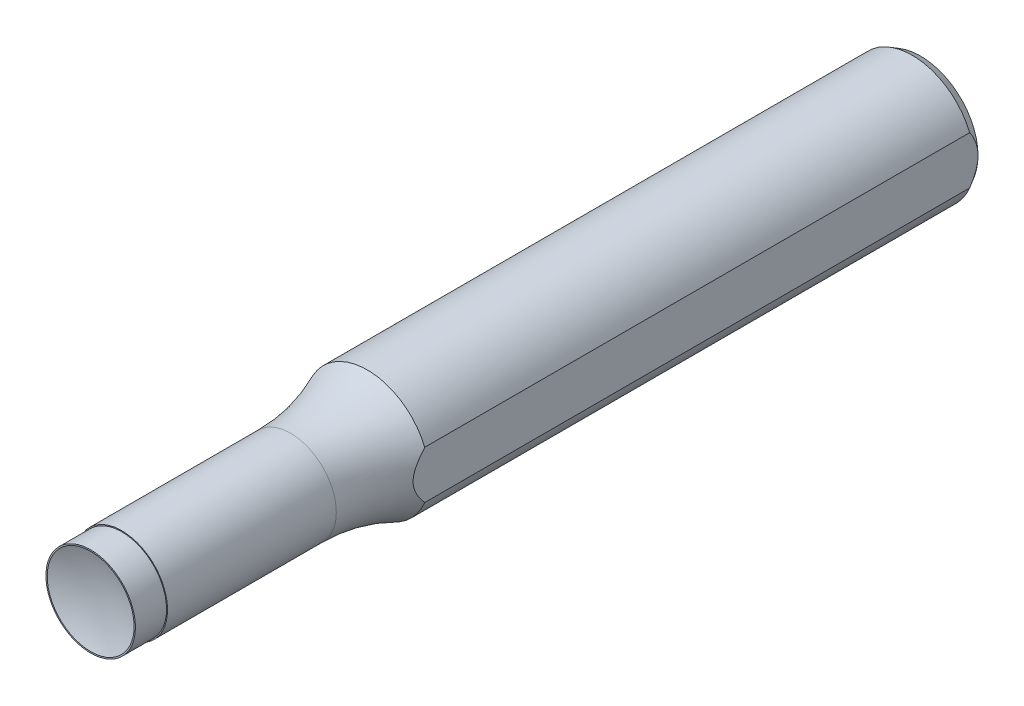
from build123d import *

# Parameters (mm, degrees)
SKETCH1_R           = 9.525
BOSS_EXTRUDE1_DEPTH = 127
SKETCH2_OUTSIDE_W   = 47.016
SKETCH2_OUTSIDE_H   = 47.016
SKETCH2_OUTSIDE_R   = 7
CUT_EXTRUDE1_DEPTH  = 42.333333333
SKETCH3_OUTSIDE_W   = 47.016
SKETCH3_OUTSIDE_H   = 47.016
SKETCH3_OUTSIDE_R   = 6.85
CUT_EXTRUDE2_DEPTH  = 4.7625
CHAMFER1_SIZE       = 1.27
CHAMFER1_SIZE2      = 0.733234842
SKETCH7_W           = 7.329526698
SKETCH7_H           = 7.329526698
CUT_EXTRUDE3_DEPTH  = 128.712377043


with BuildPart() as part:
    # Sketch1 → Boss-Extrude1 (new body)
    with BuildSketch(Plane.XY):
        Circle(SKETCH1_R)
    extrude(amount=-BOSS_EXTRUDE1_DEPTH)

    # Sketch2 outside → Cut-Extrude1 (cut)
    with BuildSketch(Plane.XY):
        Rectangle(SKETCH2_OUTSIDE_W, SKETCH2_OUTSIDE_H)
        Circle(SKETCH2_OUTSIDE_R, mode=Mode.SUBTRACT)
    extrude(amount=-CUT_EXTRUDE1_DEPTH, mode=Mode.SUBTRACT)

    # Sketch3 outside → Cut-Extrude2 (cut)
    with BuildSketch(Plane.XY):
        Rectangle(SKETCH3_OUTSIDE_W, SKETCH3_OUTSIDE_H)
        Circle(SKETCH3_OUTSIDE_R, mode=Mode.SUBTRACT)
    extrude(amount=-CUT_EXTRUDE2_DEPTH, mode=Mode.SUBTRACT)

    # Sketch4 → Cut-Revolve1 (revolve, cut)
    with BuildSketch(Plane(origin=(0, 0, 0), x_dir=(0, 0, -1), z_dir=(1, 0, 0)), mode=Mode.PRIVATE) as cut_revolve1_sk:
        with BuildLine():
            Line((0, 0), (0, 6.65))
            ThreePointArc((0, 6.65), (0.896398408, 3.378558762), (1.198389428, 0))
            Line((1.198389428, 0), (0, 0))
        make_face()
    revolve(cut_revolve1_sk.sketch.rotate(Axis((0, 0, 0), (0, 0, -1)), 180), axis=Axis((0, 0, 0), (0, 0, -1)), mode=Mode.SUBTRACT)

    # Chamfer1
    chamfer1_edges = [part.edges().sort_by_distance(p)[0] for p in [
        (-9.525, 0, -127),
    ]]
    chamfer1_side = [part.faces().sort_by_distance(p)[0] for p in [
        (-9.525, 0, -84.666666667),
    ]]
    chamfer(chamfer1_edges, length=CHAMFER1_SIZE, length2=CHAMFER1_SIZE2, reference=chamfer1_side[0])

    # Sketch5 → Revolve1 (revolve)
    with BuildSketch(Plane(origin=(0, 0, 0), x_dir=(0, 0, -1), z_dir=(1, 0, 0)), mode=Mode.PRIVATE) as revolve1_sk:
        with BuildLine():
            Line((42.333333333, 0), (30.58905281, 0))
            Line((30.58905281, 0), (30.58905281, 7))
            ThreePointArc((30.58905281, 7), (36.595377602, 7.638380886), (42.333333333, 9.525))
            Line((42.333333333, 9.525), (42.333333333, 0))
        make_face()
    revolve(revolve1_sk.sketch.rotate(Axis((0, 0, -42.333333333), (0, 0, 1)), 270), axis=Axis((0, 0, -42.333333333), (0, 0, 1)))

    # Sketch7 → Cut-Extrude3 (cut, through all)
    with BuildSketch(Plane(origin=(0, 0, -127), x_dir=(-1, 0, 0), z_dir=(0, 0, -1))):
        with Locations((-12.456528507, 0)):
            Rectangle(SKETCH7_W, SKETCH7_H)
    extrude(amount=-CUT_EXTRUDE3_DEPTH, mode=Mode.SUBTRACT)


solid = part.part
